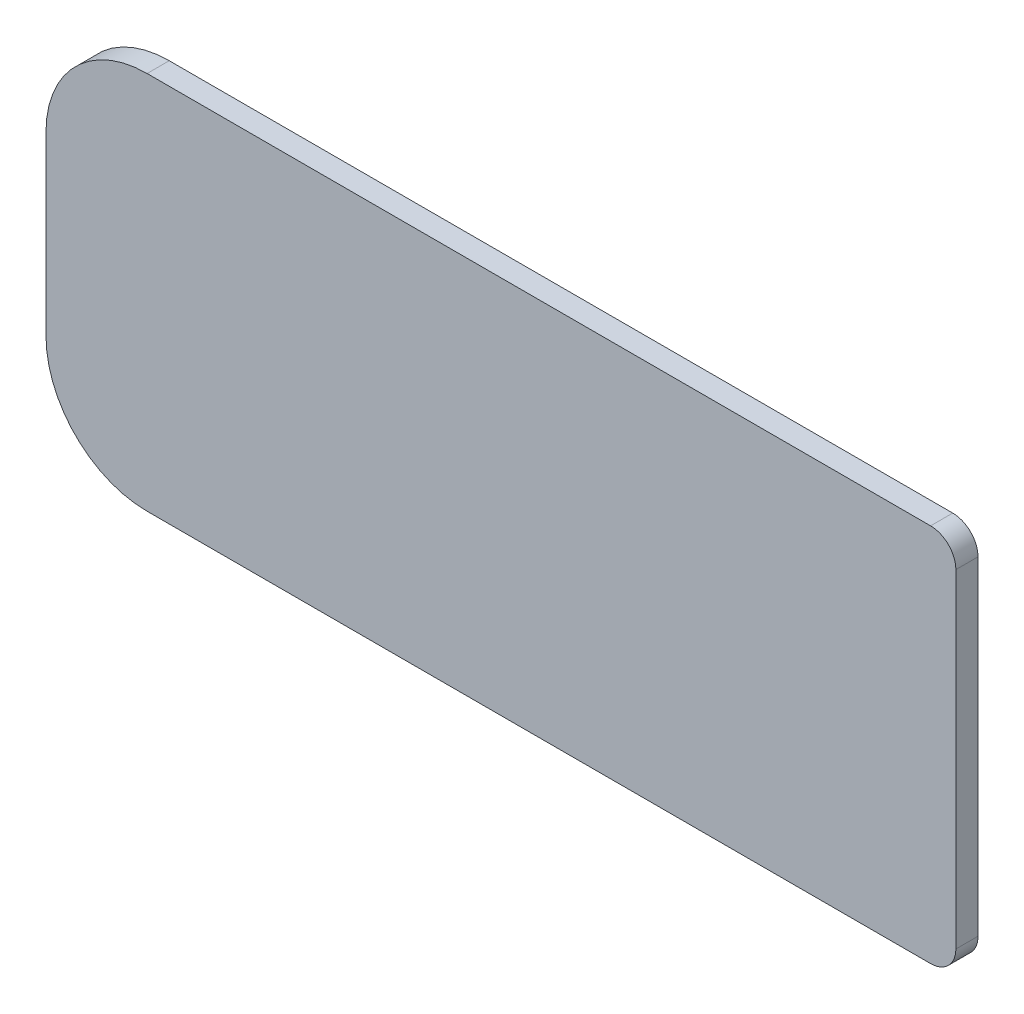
from build123d import *

# Parameters (mm, degrees)
BOSS_EXTRUDE1_DEPTH = 11.1252
FILLET1_R           = 50.8
FILLET2_R           = 12.7


with BuildPart() as part:
    # Sketch2 → Boss-Extrude1 (new body)
    with BuildSketch(Plane.XY):
        Polygon((0, -95.25), (457.2, -95.25), (457.2, 95.25), (0, 95.25), (0, 0), align=None)
    extrude(amount=BOSS_EXTRUDE1_DEPTH)

    # Fillet1
    fillet1_edges = [part.edges().sort_by_distance(p)[0] for p in [
        (0, 95.25, 5.5626),
        (0, -95.25, 5.5626),
    ]]
    fillet(fillet1_edges, radius=FILLET1_R)

    # Fillet2
    fillet2_edges = [part.edges().sort_by_distance(p)[0] for p in [
        (457.2, 95.25, 5.5626),
        (457.2, -95.25, 5.5626),
    ]]
    fillet(fillet2_edges, radius=FILLET2_R)


solid = part.part
